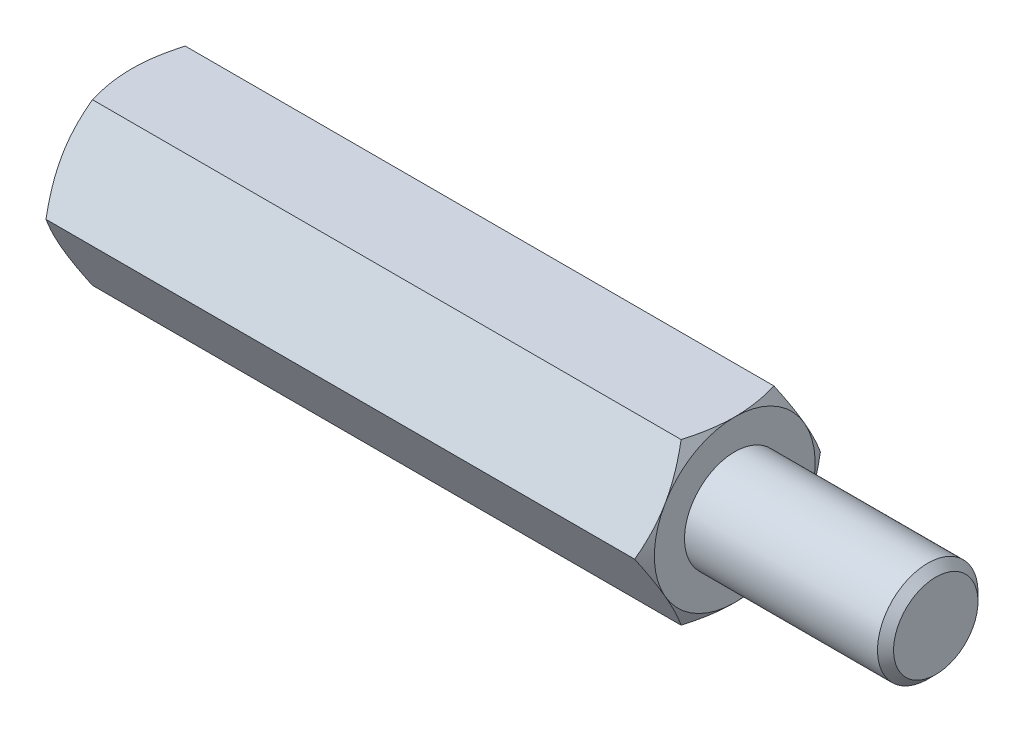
from build123d import *

# Parameters (mm, degrees)
EXTRUDE2_DEPTH = 15
SKETCH3_R      = 2.1
EXTRUDE3_DEPTH = 10
SKETCH5_R      = 2.5
EXTRUDE4_DEPTH = 10
CHAMFER1_SIZE  = 0.4


with BuildPart() as part:
    # Sketch1 → Extrude2 (new, symmetric)
    with BuildSketch(Plane(origin=(0, 0, 0), x_dir=(0, 0, -1), z_dir=(1, 0, 0))):
        Polygon((2.309401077, 4), (-2.309401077, 4), (-4.618802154, 0), (-2.309401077, -4), (2.309401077, -4), (4.618802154, 0), align=None)
    extrude(amount=EXTRUDE2_DEPTH, both=True)

    # Sketch2 → Cut-Revolve1 (revolve, cut)
    with BuildSketch(Plane.XY):
        with BuildLine():
            Line((-15, 4), (-13.5, 6.598076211))
            ThreePointArc((-13.5, 6.598076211), (-13.98810136, 7.776457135), (-15, 7))
            Line((-15, 7), (-15, 4))
        make_face()
    cut_revolve1 = revolve(axis=Axis((0, 0, 0), (1, 0, 0)), mode=Mode.SUBTRACT)

    # Mirror1: Cut-Revolve1 across plane
    add(cut_revolve1.mirror(Plane(origin=(0, 0, 0), x_dir=(0, 0, 1), z_dir=(1, 0, 0))), mode=Mode.SUBTRACT)

    # Sketch3 → Extrude3 (cut)
    with BuildSketch(Plane.ZY.offset(15)):
        Circle(SKETCH3_R)
    extrude(amount=-EXTRUDE3_DEPTH, mode=Mode.SUBTRACT)

    # Sketch4 → Cut-Revolve2 (revolve, cut)
    with BuildSketch(Plane.XY, mode=Mode.PRIVATE) as cut_revolve2_sk:
        Polygon((-5, 0), (-5, 2.1), (-3.787564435, 0), align=None)
    revolve(cut_revolve2_sk.sketch.rotate(Axis((-3.787564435, 0, 0), (-1, 0, 0)), 270), axis=Axis((-3.787564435, 0, 0), (-1, 0, 0)), mode=Mode.SUBTRACT)

    # Sketch5 → Extrude4 (add)
    with BuildSketch(Plane(origin=(15, 0, 0), x_dir=(0, 0, -1), z_dir=(1, 0, 0))):
        Circle(SKETCH5_R)
    extrude(amount=EXTRUDE4_DEPTH)

    # Chamfer1
    chamfer1_edges = [part.edges().sort_by_distance(p)[0] for p in [
        (25, 0, 2.5),
    ]]
    chamfer(chamfer1_edges, length=CHAMFER1_SIZE)


solid = part.part
